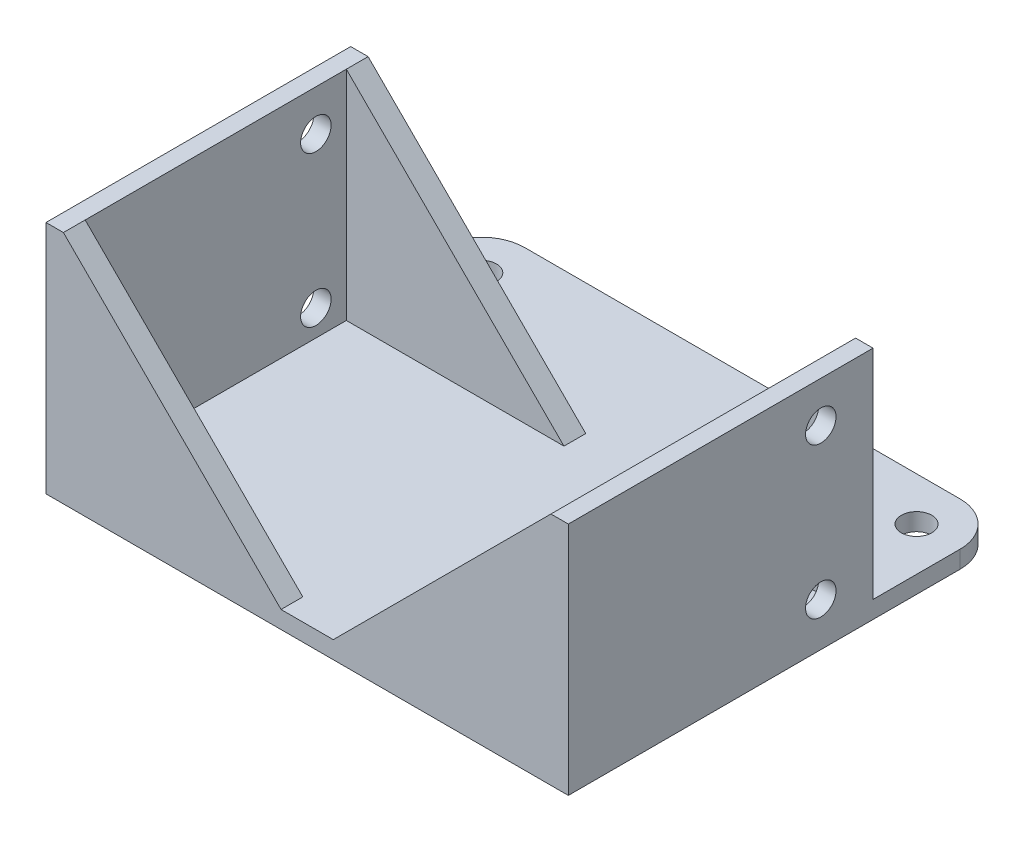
ISO-10303-21;
HEADER;
FILE_DESCRIPTION(('STEP AP214'),'2;1');
FILE_NAME('part.step','',(''),(''),'','','');
FILE_SCHEMA(('AUTOMOTIVE_DESIGN { 1 0 10303 214 1 1 1 1 }'));
ENDSEC;
DATA;
#1=APPLICATION_CONTEXT('core data for automotive mechanical design processes');
#2=APPLICATION_PROTOCOL_DEFINITION('international standard','automotive_design',2000,#1);
#3=PRODUCT_CONTEXT('',#1,'mechanical');
#4=PRODUCT('Part','Part','',(#3));
#5=PRODUCT_RELATED_PRODUCT_CATEGORY('part','',(#4));
#6=PRODUCT_DEFINITION_FORMATION('','',#4);
#7=PRODUCT_DEFINITION_CONTEXT('part definition',#1,'design');
#8=PRODUCT_DEFINITION('design','',#6,#7);
#9=PRODUCT_DEFINITION_SHAPE('','',#8);
#10=(LENGTH_UNIT() NAMED_UNIT(*) SI_UNIT(.MILLI.,.METRE.));
#11=(NAMED_UNIT(*) PLANE_ANGLE_UNIT() SI_UNIT($,.RADIAN.));
#12=(NAMED_UNIT(*) SI_UNIT($,.STERADIAN.) SOLID_ANGLE_UNIT());
#13=UNCERTAINTY_MEASURE_WITH_UNIT(LENGTH_MEASURE(1.E-05),#10,'distance_accuracy_value','');
#14=(GEOMETRIC_REPRESENTATION_CONTEXT(3) GLOBAL_UNCERTAINTY_ASSIGNED_CONTEXT((#13)) GLOBAL_UNIT_ASSIGNED_CONTEXT((#10,
#11,#12)) REPRESENTATION_CONTEXT('',''));
#15=CARTESIAN_POINT('',(0.,0.,0.));
#16=DIRECTION('',(0.,0.,1.));
#17=DIRECTION('',(1.,0.,0.));
#18=AXIS2_PLACEMENT_3D('',#15,#16,#17);
#19=CARTESIAN_POINT('',(-28.,27.,-48.1837661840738));
#20=DIRECTION('',(0.707106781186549,0.707106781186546,0.));
#21=DIRECTION('',(-0.707106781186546,0.707106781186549,0.));
#22=AXIS2_PLACEMENT_3D('',#19,#20,#21);
#23=PLANE('',#22);
#24=DIRECTION('',(0.,0.,1.));
#25=VECTOR('',#24,1.);
#26=CARTESIAN_POINT('',(-3.00000000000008,2.,-48.1837661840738));
#27=LINE('',#26,#25);
#28=CARTESIAN_POINT('',(-3.00000000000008,2.,22.5));
#29=VERTEX_POINT('',#28);
#30=CARTESIAN_POINT('',(-3.00000000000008,2.,25.));
#31=VERTEX_POINT('',#30);
#32=EDGE_CURVE('E249',#29,#31,#27,.T.);
#33=ORIENTED_EDGE('',*,*,#32,.F.);
#34=DIRECTION('',(-0.707106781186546,0.707106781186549,0.));
#35=VECTOR('',#34,1.);
#36=CARTESIAN_POINT('',(-28.,27.,22.5));
#37=LINE('',#36,#35);
#38=CARTESIAN_POINT('',(-28.,27.,22.5));
#39=VERTEX_POINT('',#38);
#40=EDGE_CURVE('E216',#29,#39,#37,.T.);
#41=ORIENTED_EDGE('',*,*,#40,.T.);
#42=DIRECTION('',(0.,0.,-1.));
#43=VECTOR('',#42,1.);
#44=CARTESIAN_POINT('',(-28.,27.,25.));
#45=LINE('',#44,#43);
#46=CARTESIAN_POINT('',(-28.,27.,25.));
#47=VERTEX_POINT('',#46);
#48=EDGE_CURVE('E286',#47,#39,#45,.T.);
#49=ORIENTED_EDGE('',*,*,#48,.F.);
#50=DIRECTION('',(-0.707106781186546,0.707106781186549,0.));
#51=VECTOR('',#50,1.);
#52=CARTESIAN_POINT('',(-28.,27.,25.));
#53=LINE('',#52,#51);
#54=EDGE_CURVE('E239',#31,#47,#53,.T.);
#55=ORIENTED_EDGE('',*,*,#54,.F.);
#56=EDGE_LOOP('',(#33,#41,#49,#55));
#57=FACE_BOUND('',#56,.T.);
#58=ADVANCED_FACE('F42',(#57),#23,.T.);
#59=CARTESIAN_POINT('',(28.,27.,-48.1837661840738));
#60=DIRECTION('',(-0.707106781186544,0.707106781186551,0.));
#61=DIRECTION('',(-0.707106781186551,-0.707106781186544,0.));
#62=AXIS2_PLACEMENT_3D('',#59,#60,#61);
#63=PLANE('',#62);
#64=DIRECTION('',(0.,0.,1.));
#65=VECTOR('',#64,1.);
#66=CARTESIAN_POINT('',(28.,27.,25.));
#67=LINE('',#66,#65);
#68=CARTESIAN_POINT('',(28.,27.,22.5));
#69=VERTEX_POINT('',#68);
#70=CARTESIAN_POINT('',(28.,27.,25.));
#71=VERTEX_POINT('',#70);
#72=EDGE_CURVE('E265',#69,#71,#67,.T.);
#73=ORIENTED_EDGE('',*,*,#72,.F.);
#74=DIRECTION('',(-0.707106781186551,-0.707106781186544,0.));
#75=VECTOR('',#74,1.);
#76=CARTESIAN_POINT('',(28.,27.,22.5));
#77=LINE('',#76,#75);
#78=CARTESIAN_POINT('',(2.99999999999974,2.,22.5));
#79=VERTEX_POINT('',#78);
#80=EDGE_CURVE('E334',#69,#79,#77,.T.);
#81=ORIENTED_EDGE('',*,*,#80,.T.);
#82=DIRECTION('',(0.,0.,1.));
#83=VECTOR('',#82,1.);
#84=CARTESIAN_POINT('',(2.99999999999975,2.,-48.1837661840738));
#85=LINE('',#84,#83);
#86=CARTESIAN_POINT('',(2.99999999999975,2.,25.));
#87=VERTEX_POINT('',#86);
#88=EDGE_CURVE('E231',#79,#87,#85,.T.);
#89=ORIENTED_EDGE('',*,*,#88,.T.);
#90=DIRECTION('',(-0.707106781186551,-0.707106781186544,0.));
#91=VECTOR('',#90,1.);
#92=CARTESIAN_POINT('',(28.,27.,25.));
#93=LINE('',#92,#91);
#94=EDGE_CURVE('E235',#71,#87,#93,.T.);
#95=ORIENTED_EDGE('',*,*,#94,.F.);
#96=EDGE_LOOP('',(#73,#81,#89,#95));
#97=FACE_BOUND('',#96,.T.);
#98=ADVANCED_FACE('F445',(#97),#63,.T.);
#99=CARTESIAN_POINT('',(0.,2.,0.));
#100=DIRECTION('',(0.,-1.,0.));
#101=DIRECTION('',(0.,0.,-1.));
#102=AXIS2_PLACEMENT_3D('',#99,#100,#101);
#103=PLANE('',#102);
#104=CARTESIAN_POINT('',(-25.,2.,-20.));
#105=DIRECTION('',(0.,-1.,0.));
#106=DIRECTION('',(0.,0.,-1.));
#107=AXIS2_PLACEMENT_3D('',#104,#105,#106);
#108=CIRCLE('',#107,1.75);
#109=CARTESIAN_POINT('',(-25.,2.,-21.75));
#110=VERTEX_POINT('',#109);
#111=EDGE_CURVE('E398',#110,#110,#108,.T.);
#112=ORIENTED_EDGE('',*,*,#111,.T.);
#113=EDGE_LOOP('',(#112));
#114=FACE_BOUND('',#113,.T.);
#115=CARTESIAN_POINT('',(25.,2.,-20.));
#116=DIRECTION('',(0.,-1.,0.));
#117=DIRECTION('',(0.,0.,-1.));
#118=AXIS2_PLACEMENT_3D('',#115,#116,#117);
#119=CIRCLE('',#118,1.75);
#120=CARTESIAN_POINT('',(25.,2.,-21.75));
#121=VERTEX_POINT('',#120);
#122=EDGE_CURVE('E385',#121,#121,#119,.T.);
#123=ORIENTED_EDGE('',*,*,#122,.T.);
#124=EDGE_LOOP('',(#123));
#125=FACE_BOUND('',#124,.T.);
#126=CARTESIAN_POINT('',(25.,2.,20.));
#127=DIRECTION('',(0.,-1.,0.));
#128=DIRECTION('',(0.,0.,-1.));
#129=AXIS2_PLACEMENT_3D('',#126,#127,#128);
#130=CIRCLE('',#129,1.75);
#131=CARTESIAN_POINT('',(25.,2.,18.25));
#132=VERTEX_POINT('',#131);
#133=EDGE_CURVE('E381',#132,#132,#130,.T.);
#134=ORIENTED_EDGE('',*,*,#133,.T.);
#135=EDGE_LOOP('',(#134));
#136=FACE_BOUND('',#135,.T.);
#137=CARTESIAN_POINT('',(-25.,2.,20.));
#138=DIRECTION('',(0.,-1.,0.));
#139=DIRECTION('',(0.,0.,-1.));
#140=AXIS2_PLACEMENT_3D('',#137,#138,#139);
#141=CIRCLE('',#140,1.75);
#142=CARTESIAN_POINT('',(-25.,2.,18.25));
#143=VERTEX_POINT('',#142);
#144=EDGE_CURVE('E377',#143,#143,#141,.T.);
#145=ORIENTED_EDGE('',*,*,#144,.T.);
#146=EDGE_LOOP('',(#145));
#147=FACE_BOUND('',#146,.T.);
#148=DIRECTION('',(-1.,0.,0.));
#149=VECTOR('',#148,1.);
#150=CARTESIAN_POINT('',(-30.,2.,-25.));
#151=LINE('',#150,#149);
#152=CARTESIAN_POINT('',(25.,2.,-25.));
#153=VERTEX_POINT('',#152);
#154=CARTESIAN_POINT('',(-25.,2.,-25.));
#155=VERTEX_POINT('',#154);
#156=EDGE_CURVE('E305',#153,#155,#151,.T.);
#157=ORIENTED_EDGE('',*,*,#156,.T.);
#158=CARTESIAN_POINT('',(-25.,2.,-20.));
#159=DIRECTION('',(0.,-1.,0.));
#160=DIRECTION('',(0.,0.,-1.));
#161=AXIS2_PLACEMENT_3D('',#158,#159,#160);
#162=CIRCLE('',#161,5.);
#163=CARTESIAN_POINT('',(-30.,2.,-20.));
#164=VERTEX_POINT('',#163);
#165=EDGE_CURVE('E52',#155,#164,#162,.F.);
#166=ORIENTED_EDGE('',*,*,#165,.T.);
#167=DIRECTION('',(0.,0.,1.));
#168=VECTOR('',#167,1.);
#169=CARTESIAN_POINT('',(-30.,2.,25.));
#170=LINE('',#169,#168);
#171=CARTESIAN_POINT('',(-30.,2.,-10.));
#172=VERTEX_POINT('',#171);
#173=EDGE_CURVE('E309',#164,#172,#170,.T.);
#174=ORIENTED_EDGE('',*,*,#173,.T.);
#175=DIRECTION('',(-1.,0.,0.));
#176=VECTOR('',#175,1.);
#177=CARTESIAN_POINT('',(-30.,2.,-10.));
#178=LINE('',#177,#176);
#179=CARTESIAN_POINT('',(-3.00000000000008,2.,-10.));
#180=VERTEX_POINT('',#179);
#181=EDGE_CURVE('E260',#180,#172,#178,.T.);
#182=ORIENTED_EDGE('',*,*,#181,.F.);
#183=CARTESIAN_POINT('',(-3.00000000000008,2.,-7.5));
#184=VERTEX_POINT('',#183);
#185=EDGE_CURVE('E245',#180,#184,#27,.T.);
#186=ORIENTED_EDGE('',*,*,#185,.T.);
#187=DIRECTION('',(1.,0.,0.));
#188=VECTOR('',#187,1.);
#189=CARTESIAN_POINT('',(-28.,2.,-7.5));
#190=LINE('',#189,#188);
#191=CARTESIAN_POINT('',(-28.,2.,-7.5));
#192=VERTEX_POINT('',#191);
#193=EDGE_CURVE('E194',#192,#184,#190,.T.);
#194=ORIENTED_EDGE('',*,*,#193,.F.);
#195=DIRECTION('',(0.,0.,-1.));
#196=VECTOR('',#195,1.);
#197=CARTESIAN_POINT('',(-28.,2.,22.5));
#198=LINE('',#197,#196);
#199=CARTESIAN_POINT('',(-28.,2.,22.5));
#200=VERTEX_POINT('',#199);
#201=EDGE_CURVE('E185',#200,#192,#198,.T.);
#202=ORIENTED_EDGE('',*,*,#201,.F.);
#203=DIRECTION('',(1.,0.,0.));
#204=VECTOR('',#203,1.);
#205=CARTESIAN_POINT('',(-28.,2.,22.5));
#206=LINE('',#205,#204);
#207=EDGE_CURVE('E205',#200,#29,#206,.T.);
#208=ORIENTED_EDGE('',*,*,#207,.T.);
#209=ORIENTED_EDGE('',*,*,#32,.T.);
#210=DIRECTION('',(1.,0.,0.));
#211=VECTOR('',#210,1.);
#212=CARTESIAN_POINT('',(-30.,2.,25.));
#213=LINE('',#212,#211);
#214=EDGE_CURVE('E312',#31,#87,#213,.T.);
#215=ORIENTED_EDGE('',*,*,#214,.T.);
#216=ORIENTED_EDGE('',*,*,#88,.F.);
#217=CARTESIAN_POINT('',(28.,2.,22.5));
#218=VERTEX_POINT('',#217);
#219=EDGE_CURVE('E200',#79,#218,#206,.T.);
#220=ORIENTED_EDGE('',*,*,#219,.T.);
#221=DIRECTION('',(0.,0.,-1.));
#222=VECTOR('',#221,1.);
#223=CARTESIAN_POINT('',(28.,2.,22.5));
#224=LINE('',#223,#222);
#225=CARTESIAN_POINT('',(28.,2.,-7.5));
#226=VERTEX_POINT('',#225);
#227=EDGE_CURVE('E177',#218,#226,#224,.T.);
#228=ORIENTED_EDGE('',*,*,#227,.T.);
#229=CARTESIAN_POINT('',(2.99999999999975,2.,-7.5));
#230=VERTEX_POINT('',#229);
#231=EDGE_CURVE('E187',#230,#226,#190,.T.);
#232=ORIENTED_EDGE('',*,*,#231,.F.);
#233=CARTESIAN_POINT('',(2.99999999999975,2.,-10.));
#234=VERTEX_POINT('',#233);
#235=EDGE_CURVE('E232',#234,#230,#85,.T.);
#236=ORIENTED_EDGE('',*,*,#235,.F.);
#237=DIRECTION('',(-1.,0.,0.));
#238=VECTOR('',#237,1.);
#239=CARTESIAN_POINT('',(30.,2.,-10.));
#240=LINE('',#239,#238);
#241=CARTESIAN_POINT('',(30.,2.,-10.));
#242=VERTEX_POINT('',#241);
#243=EDGE_CURVE('E257',#242,#234,#240,.T.);
#244=ORIENTED_EDGE('',*,*,#243,.F.);
#245=DIRECTION('',(0.,0.,-1.));
#246=VECTOR('',#245,1.);
#247=CARTESIAN_POINT('',(30.,2.,25.));
#248=LINE('',#247,#246);
#249=CARTESIAN_POINT('',(30.,2.,-20.));
#250=VERTEX_POINT('',#249);
#251=EDGE_CURVE('E302',#242,#250,#248,.T.);
#252=ORIENTED_EDGE('',*,*,#251,.T.);
#253=CARTESIAN_POINT('',(25.,2.,-20.));
#254=DIRECTION('',(0.,-1.,0.));
#255=DIRECTION('',(0.,0.,-1.));
#256=AXIS2_PLACEMENT_3D('',#253,#254,#255);
#257=CIRCLE('',#256,5.);
#258=EDGE_CURVE('E368',#250,#153,#257,.F.);
#259=ORIENTED_EDGE('',*,*,#258,.T.);
#260=EDGE_LOOP('',(#157,#166,#174,#182,#186,#194,#202,#208,#209,#215,#216,#220,#228,#232,#236,
#244,#252,#259));
#261=FACE_BOUND('',#260,.T.);
#262=ADVANCED_FACE('F198',(#114,#125,#136,#147,#261),#103,.F.);
#263=CARTESIAN_POINT('',(30.,2.,25.));
#264=DIRECTION('',(-1.,0.,0.));
#265=DIRECTION('',(0.,0.,1.));
#266=AXIS2_PLACEMENT_3D('',#263,#264,#265);
#267=PLANE('',#266);
#268=CARTESIAN_POINT('',(30.,22.3,-4.));
#269=DIRECTION('',(-1.,0.,0.));
#270=DIRECTION('',(0.,0.,1.));
#271=AXIS2_PLACEMENT_3D('',#268,#269,#270);
#272=CIRCLE('',#271,1.75);
#273=CARTESIAN_POINT('',(30.,22.3,-2.25));
#274=VERTEX_POINT('',#273);
#275=EDGE_CURVE('E346',#274,#274,#272,.T.);
#276=ORIENTED_EDGE('',*,*,#275,.T.);
#277=EDGE_LOOP('',(#276));
#278=FACE_BOUND('',#277,.T.);
#279=CARTESIAN_POINT('',(30.,5.,-4.));
#280=DIRECTION('',(-1.,0.,0.));
#281=DIRECTION('',(0.,0.,1.));
#282=AXIS2_PLACEMENT_3D('',#279,#280,#281);
#283=CIRCLE('',#282,1.75);
#284=CARTESIAN_POINT('',(30.,5.,-2.25));
#285=VERTEX_POINT('',#284);
#286=EDGE_CURVE('E402',#285,#285,#283,.T.);
#287=ORIENTED_EDGE('',*,*,#286,.T.);
#288=EDGE_LOOP('',(#287));
#289=FACE_BOUND('',#288,.T.);
#290=DIRECTION('',(0.,0.,-1.));
#291=VECTOR('',#290,1.);
#292=CARTESIAN_POINT('',(30.,0.,25.));
#293=LINE('',#292,#291);
#294=CARTESIAN_POINT('',(30.,0.,25.));
#295=VERTEX_POINT('',#294);
#296=CARTESIAN_POINT('',(30.,0.,-20.));
#297=VERTEX_POINT('',#296);
#298=EDGE_CURVE('E301',#295,#297,#293,.T.);
#299=ORIENTED_EDGE('',*,*,#298,.T.);
#300=DIRECTION('',(0.,-1.,0.));
#301=VECTOR('',#300,1.);
#302=CARTESIAN_POINT('',(30.,2.,-20.));
#303=LINE('',#302,#301);
#304=EDGE_CURVE('E11',#297,#250,#303,.F.);
#305=ORIENTED_EDGE('',*,*,#304,.T.);
#306=ORIENTED_EDGE('',*,*,#251,.F.);
#307=DIRECTION('',(0.,-1.,0.));
#308=VECTOR('',#307,1.);
#309=CARTESIAN_POINT('',(30.,27.,-10.));
#310=LINE('',#309,#308);
#311=CARTESIAN_POINT('',(30.,27.,-10.));
#312=VERTEX_POINT('',#311);
#313=EDGE_CURVE('E244',#312,#242,#310,.T.);
#314=ORIENTED_EDGE('',*,*,#313,.F.);
#315=DIRECTION('',(0.,0.,-1.));
#316=VECTOR('',#315,1.);
#317=CARTESIAN_POINT('',(30.,27.,25.));
#318=LINE('',#317,#316);
#319=CARTESIAN_POINT('',(30.,27.,25.));
#320=VERTEX_POINT('',#319);
#321=EDGE_CURVE('E261',#320,#312,#318,.T.);
#322=ORIENTED_EDGE('',*,*,#321,.F.);
#323=DIRECTION('',(0.,-1.,0.));
#324=VECTOR('',#323,1.);
#325=CARTESIAN_POINT('',(30.,2.,25.));
#326=LINE('',#325,#324);
#327=EDGE_CURVE('E316',#320,#295,#326,.T.);
#328=ORIENTED_EDGE('',*,*,#327,.T.);
#329=EDGE_LOOP('',(#299,#305,#306,#314,#322,#328));
#330=FACE_BOUND('',#329,.T.);
#331=ADVANCED_FACE('F508',(#278,#289,#330),#267,.F.);
#332=CARTESIAN_POINT('',(-30.,2.,-25.));
#333=DIRECTION('',(0.,0.,1.));
#334=DIRECTION('',(1.,0.,0.));
#335=AXIS2_PLACEMENT_3D('',#332,#333,#334);
#336=PLANE('',#335);
#337=DIRECTION('',(-1.,0.,0.));
#338=VECTOR('',#337,1.);
#339=CARTESIAN_POINT('',(-30.,0.,-25.));
#340=LINE('',#339,#338);
#341=CARTESIAN_POINT('',(25.,0.,-25.));
#342=VERTEX_POINT('',#341);
#343=CARTESIAN_POINT('',(-25.,0.,-25.));
#344=VERTEX_POINT('',#343);
#345=EDGE_CURVE('E319',#342,#344,#340,.T.);
#346=ORIENTED_EDGE('',*,*,#345,.T.);
#347=DIRECTION('',(0.,-1.,0.));
#348=VECTOR('',#347,1.);
#349=CARTESIAN_POINT('',(-25.,2.,-25.));
#350=LINE('',#349,#348);
#351=EDGE_CURVE('E66',#344,#155,#350,.F.);
#352=ORIENTED_EDGE('',*,*,#351,.T.);
#353=ORIENTED_EDGE('',*,*,#156,.F.);
#354=DIRECTION('',(0.,-1.,0.));
#355=VECTOR('',#354,1.);
#356=CARTESIAN_POINT('',(25.,2.,-25.));
#357=LINE('',#356,#355);
#358=EDGE_CURVE('E362',#153,#342,#357,.T.);
#359=ORIENTED_EDGE('',*,*,#358,.T.);
#360=EDGE_LOOP('',(#346,#352,#353,#359));
#361=FACE_BOUND('',#360,.T.);
#362=ADVANCED_FACE('F514',(#361),#336,.F.);
#363=CARTESIAN_POINT('',(-30.,2.,25.));
#364=DIRECTION('',(1.,0.,0.));
#365=DIRECTION('',(0.,0.,-1.));
#366=AXIS2_PLACEMENT_3D('',#363,#364,#365);
#367=PLANE('',#366);
#368=CARTESIAN_POINT('',(-30.,22.3,-4.));
#369=DIRECTION('',(1.,0.,0.));
#370=DIRECTION('',(0.,0.,-1.));
#371=AXIS2_PLACEMENT_3D('',#368,#369,#370);
#372=CIRCLE('',#371,1.75);
#373=CARTESIAN_POINT('',(-30.,22.3,-5.75));
#374=VERTEX_POINT('',#373);
#375=EDGE_CURVE('E195',#374,#374,#372,.T.);
#376=ORIENTED_EDGE('',*,*,#375,.T.);
#377=EDGE_LOOP('',(#376));
#378=FACE_BOUND('',#377,.T.);
#379=CARTESIAN_POINT('',(-30.,5.,-4.));
#380=DIRECTION('',(1.,0.,0.));
#381=DIRECTION('',(0.,0.,-1.));
#382=AXIS2_PLACEMENT_3D('',#379,#380,#381);
#383=CIRCLE('',#382,1.75);
#384=CARTESIAN_POINT('',(-30.,5.,-5.75));
#385=VERTEX_POINT('',#384);
#386=EDGE_CURVE('E352',#385,#385,#383,.T.);
#387=ORIENTED_EDGE('',*,*,#386,.T.);
#388=EDGE_LOOP('',(#387));
#389=FACE_BOUND('',#388,.T.);
#390=ORIENTED_EDGE('',*,*,#173,.F.);
#391=DIRECTION('',(0.,-1.,0.));
#392=VECTOR('',#391,1.);
#393=CARTESIAN_POINT('',(-30.,2.,-20.));
#394=LINE('',#393,#392);
#395=CARTESIAN_POINT('',(-30.,0.,-20.));
#396=VERTEX_POINT('',#395);
#397=EDGE_CURVE('E340',#164,#396,#394,.T.);
#398=ORIENTED_EDGE('',*,*,#397,.T.);
#399=DIRECTION('',(0.,0.,1.));
#400=VECTOR('',#399,1.);
#401=CARTESIAN_POINT('',(-30.,0.,25.));
#402=LINE('',#401,#400);
#403=CARTESIAN_POINT('',(-30.,0.,25.));
#404=VERTEX_POINT('',#403);
#405=EDGE_CURVE('E322',#396,#404,#402,.T.);
#406=ORIENTED_EDGE('',*,*,#405,.T.);
#407=DIRECTION('',(0.,-1.,0.));
#408=VECTOR('',#407,1.);
#409=CARTESIAN_POINT('',(-30.,2.,25.));
#410=LINE('',#409,#408);
#411=CARTESIAN_POINT('',(-30.,27.,25.));
#412=VERTEX_POINT('',#411);
#413=EDGE_CURVE('E330',#412,#404,#410,.T.);
#414=ORIENTED_EDGE('',*,*,#413,.F.);
#415=DIRECTION('',(0.,0.,1.));
#416=VECTOR('',#415,1.);
#417=CARTESIAN_POINT('',(-30.,27.,25.));
#418=LINE('',#417,#416);
#419=CARTESIAN_POINT('',(-30.,27.,-10.));
#420=VERTEX_POINT('',#419);
#421=EDGE_CURVE('E277',#420,#412,#418,.T.);
#422=ORIENTED_EDGE('',*,*,#421,.F.);
#423=DIRECTION('',(0.,-1.,0.));
#424=VECTOR('',#423,1.);
#425=CARTESIAN_POINT('',(-30.,27.,-10.));
#426=LINE('',#425,#424);
#427=EDGE_CURVE('E294',#420,#172,#426,.T.);
#428=ORIENTED_EDGE('',*,*,#427,.T.);
#429=EDGE_LOOP('',(#390,#398,#406,#414,#422,#428));
#430=FACE_BOUND('',#429,.T.);
#431=ADVANCED_FACE('F421',(#378,#389,#430),#367,.F.);
#432=CARTESIAN_POINT('',(-30.,2.,25.));
#433=DIRECTION('',(0.,0.,-1.));
#434=DIRECTION('',(-1.,0.,0.));
#435=AXIS2_PLACEMENT_3D('',#432,#433,#434);
#436=PLANE('',#435);
#437=DIRECTION('',(1.,0.,0.));
#438=VECTOR('',#437,1.);
#439=CARTESIAN_POINT('',(-30.,0.,25.));
#440=LINE('',#439,#438);
#441=EDGE_CURVE('E306',#404,#295,#440,.T.);
#442=ORIENTED_EDGE('',*,*,#441,.T.);
#443=ORIENTED_EDGE('',*,*,#327,.F.);
#444=DIRECTION('',(1.,0.,0.));
#445=VECTOR('',#444,1.);
#446=CARTESIAN_POINT('',(30.,27.,25.));
#447=LINE('',#446,#445);
#448=EDGE_CURVE('E256',#71,#320,#447,.T.);
#449=ORIENTED_EDGE('',*,*,#448,.F.);
#450=ORIENTED_EDGE('',*,*,#94,.T.);
#451=ORIENTED_EDGE('',*,*,#214,.F.);
#452=ORIENTED_EDGE('',*,*,#54,.T.);
#453=DIRECTION('',(1.,0.,0.));
#454=VECTOR('',#453,1.);
#455=CARTESIAN_POINT('',(-30.,27.,25.));
#456=LINE('',#455,#454);
#457=EDGE_CURVE('E281',#412,#47,#456,.T.);
#458=ORIENTED_EDGE('',*,*,#457,.F.);
#459=ORIENTED_EDGE('',*,*,#413,.T.);
#460=EDGE_LOOP('',(#442,#443,#449,#450,#451,#452,#458,#459));
#461=FACE_BOUND('',#460,.T.);
#462=ADVANCED_FACE('F496',(#461),#436,.F.);
#463=CARTESIAN_POINT('',(0.,0.,0.));
#464=DIRECTION('',(0.,-1.,0.));
#465=DIRECTION('',(0.,0.,-1.));
#466=AXIS2_PLACEMENT_3D('',#463,#464,#465);
#467=PLANE('',#466);
#468=CARTESIAN_POINT('',(-25.,0.,-20.));
#469=DIRECTION('',(0.,-1.,0.));
#470=DIRECTION('',(0.,0.,-1.));
#471=AXIS2_PLACEMENT_3D('',#468,#469,#470);
#472=CIRCLE('',#471,1.75);
#473=CARTESIAN_POINT('',(-25.,0.,-21.75));
#474=VERTEX_POINT('',#473);
#475=EDGE_CURVE('E46',#474,#474,#472,.T.);
#476=ORIENTED_EDGE('',*,*,#475,.F.);
#477=EDGE_LOOP('',(#476));
#478=FACE_BOUND('',#477,.T.);
#479=CARTESIAN_POINT('',(25.,0.,-20.));
#480=DIRECTION('',(0.,-1.,0.));
#481=DIRECTION('',(0.,0.,-1.));
#482=AXIS2_PLACEMENT_3D('',#479,#480,#481);
#483=CIRCLE('',#482,1.75);
#484=CARTESIAN_POINT('',(25.,0.,-21.75));
#485=VERTEX_POINT('',#484);
#486=EDGE_CURVE('E382',#485,#485,#483,.T.);
#487=ORIENTED_EDGE('',*,*,#486,.F.);
#488=EDGE_LOOP('',(#487));
#489=FACE_BOUND('',#488,.T.);
#490=CARTESIAN_POINT('',(25.,0.,20.));
#491=DIRECTION('',(0.,-1.,0.));
#492=DIRECTION('',(0.,0.,-1.));
#493=AXIS2_PLACEMENT_3D('',#490,#491,#492);
#494=CIRCLE('',#493,1.75);
#495=CARTESIAN_POINT('',(25.,0.,18.25));
#496=VERTEX_POINT('',#495);
#497=EDGE_CURVE('E378',#496,#496,#494,.T.);
#498=ORIENTED_EDGE('',*,*,#497,.F.);
#499=EDGE_LOOP('',(#498));
#500=FACE_BOUND('',#499,.T.);
#501=CARTESIAN_POINT('',(-25.,0.,20.));
#502=DIRECTION('',(0.,-1.,0.));
#503=DIRECTION('',(0.,0.,-1.));
#504=AXIS2_PLACEMENT_3D('',#501,#502,#503);
#505=CIRCLE('',#504,1.75);
#506=CARTESIAN_POINT('',(-25.,0.,18.25));
#507=VERTEX_POINT('',#506);
#508=EDGE_CURVE('E373',#507,#507,#505,.T.);
#509=ORIENTED_EDGE('',*,*,#508,.F.);
#510=EDGE_LOOP('',(#509));
#511=FACE_BOUND('',#510,.T.);
#512=ORIENTED_EDGE('',*,*,#405,.F.);
#513=CARTESIAN_POINT('',(-25.,0.,-20.));
#514=DIRECTION('',(0.,-1.,0.));
#515=DIRECTION('',(0.,0.,-1.));
#516=AXIS2_PLACEMENT_3D('',#513,#514,#515);
#517=CIRCLE('',#516,5.);
#518=EDGE_CURVE('E359',#396,#344,#517,.T.);
#519=ORIENTED_EDGE('',*,*,#518,.T.);
#520=ORIENTED_EDGE('',*,*,#345,.F.);
#521=CARTESIAN_POINT('',(25.,0.,-20.));
#522=DIRECTION('',(0.,-1.,0.));
#523=DIRECTION('',(0.,0.,-1.));
#524=AXIS2_PLACEMENT_3D('',#521,#522,#523);
#525=CIRCLE('',#524,5.);
#526=EDGE_CURVE('E356',#342,#297,#525,.T.);
#527=ORIENTED_EDGE('',*,*,#526,.T.);
#528=ORIENTED_EDGE('',*,*,#298,.F.);
#529=ORIENTED_EDGE('',*,*,#441,.F.);
#530=EDGE_LOOP('',(#512,#519,#520,#527,#528,#529));
#531=FACE_BOUND('',#530,.T.);
#532=ADVANCED_FACE('F506',(#478,#489,#500,#511,#531),#467,.T.);
#533=CARTESIAN_POINT('',(-30.,27.,-10.));
#534=DIRECTION('',(0.,0.,1.));
#535=DIRECTION('',(1.,0.,0.));
#536=AXIS2_PLACEMENT_3D('',#533,#534,#535);
#537=PLANE('',#536);
#538=ORIENTED_EDGE('',*,*,#181,.T.);
#539=ORIENTED_EDGE('',*,*,#427,.F.);
#540=DIRECTION('',(-1.,0.,0.));
#541=VECTOR('',#540,1.);
#542=CARTESIAN_POINT('',(-30.,27.,-10.));
#543=LINE('',#542,#541);
#544=CARTESIAN_POINT('',(-28.,27.,-10.));
#545=VERTEX_POINT('',#544);
#546=EDGE_CURVE('E290',#545,#420,#543,.T.);
#547=ORIENTED_EDGE('',*,*,#546,.F.);
#548=DIRECTION('',(0.707106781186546,-0.707106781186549,0.));
#549=VECTOR('',#548,1.);
#550=CARTESIAN_POINT('',(-28.,27.,-10.));
#551=LINE('',#550,#549);
#552=EDGE_CURVE('E240',#545,#180,#551,.T.);
#553=ORIENTED_EDGE('',*,*,#552,.T.);
#554=EDGE_LOOP('',(#538,#539,#547,#553));
#555=FACE_BOUND('',#554,.T.);
#556=ADVANCED_FACE('F481',(#555),#537,.F.);
#557=CARTESIAN_POINT('',(0.,27.,0.));
#558=DIRECTION('',(0.,-1.,0.));
#559=DIRECTION('',(0.,0.,-1.));
#560=AXIS2_PLACEMENT_3D('',#557,#558,#559);
#561=PLANE('',#560);
#562=ORIENTED_EDGE('',*,*,#421,.T.);
#563=ORIENTED_EDGE('',*,*,#457,.T.);
#564=ORIENTED_EDGE('',*,*,#48,.T.);
#565=CARTESIAN_POINT('',(-28.,27.,-7.5));
#566=VERTEX_POINT('',#565);
#567=EDGE_CURVE('E291',#39,#566,#45,.T.);
#568=ORIENTED_EDGE('',*,*,#567,.T.);
#569=EDGE_CURVE('E285',#566,#545,#45,.T.);
#570=ORIENTED_EDGE('',*,*,#569,.T.);
#571=ORIENTED_EDGE('',*,*,#546,.T.);
#572=EDGE_LOOP('',(#562,#563,#564,#568,#570,#571));
#573=FACE_BOUND('',#572,.T.);
#574=ADVANCED_FACE('F484',(#573),#561,.F.);
#575=CARTESIAN_POINT('',(30.,27.,-10.));
#576=DIRECTION('',(0.,0.,1.));
#577=DIRECTION('',(1.,0.,0.));
#578=AXIS2_PLACEMENT_3D('',#575,#576,#577);
#579=PLANE('',#578);
#580=ORIENTED_EDGE('',*,*,#243,.T.);
#581=DIRECTION('',(0.707106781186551,0.707106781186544,0.));
#582=VECTOR('',#581,1.);
#583=CARTESIAN_POINT('',(28.,27.,-10.));
#584=LINE('',#583,#582);
#585=CARTESIAN_POINT('',(28.,27.,-10.));
#586=VERTEX_POINT('',#585);
#587=EDGE_CURVE('E228',#234,#586,#584,.T.);
#588=ORIENTED_EDGE('',*,*,#587,.T.);
#589=DIRECTION('',(-1.,0.,0.));
#590=VECTOR('',#589,1.);
#591=CARTESIAN_POINT('',(30.,27.,-10.));
#592=LINE('',#591,#590);
#593=EDGE_CURVE('E270',#312,#586,#592,.T.);
#594=ORIENTED_EDGE('',*,*,#593,.F.);
#595=ORIENTED_EDGE('',*,*,#313,.T.);
#596=EDGE_LOOP('',(#580,#588,#594,#595));
#597=FACE_BOUND('',#596,.T.);
#598=ADVANCED_FACE('F465',(#597),#579,.F.);
#599=CARTESIAN_POINT('',(0.,27.,0.));
#600=DIRECTION('',(0.,1.,0.));
#601=DIRECTION('',(0.,0.,1.));
#602=AXIS2_PLACEMENT_3D('',#599,#600,#601);
#603=PLANE('',#602);
#604=ORIENTED_EDGE('',*,*,#321,.T.);
#605=ORIENTED_EDGE('',*,*,#593,.T.);
#606=CARTESIAN_POINT('',(28.,27.,-7.5));
#607=VERTEX_POINT('',#606);
#608=EDGE_CURVE('E266',#586,#607,#67,.T.);
#609=ORIENTED_EDGE('',*,*,#608,.T.);
#610=EDGE_CURVE('E179',#607,#69,#67,.T.);
#611=ORIENTED_EDGE('',*,*,#610,.T.);
#612=ORIENTED_EDGE('',*,*,#72,.T.);
#613=ORIENTED_EDGE('',*,*,#448,.T.);
#614=EDGE_LOOP('',(#604,#605,#609,#611,#612,#613));
#615=FACE_BOUND('',#614,.T.);
#616=ADVANCED_FACE('F458',(#615),#603,.T.);
#617=DIRECTION('',(-0.707106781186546,0.707106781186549,0.));
#618=VECTOR('',#617,1.);
#619=CARTESIAN_POINT('',(-28.,27.,-7.5));
#620=LINE('',#619,#618);
#621=EDGE_CURVE('E225',#184,#566,#620,.T.);
#622=ORIENTED_EDGE('',*,*,#621,.F.);
#623=ORIENTED_EDGE('',*,*,#185,.F.);
#624=ORIENTED_EDGE('',*,*,#552,.F.);
#625=ORIENTED_EDGE('',*,*,#569,.F.);
#626=EDGE_LOOP('',(#622,#623,#624,#625));
#627=FACE_BOUND('',#626,.T.);
#628=ADVANCED_FACE('F448',(#627),#23,.T.);
#629=DIRECTION('',(-0.707106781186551,-0.707106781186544,0.));
#630=VECTOR('',#629,1.);
#631=CARTESIAN_POINT('',(28.,27.,-7.5));
#632=LINE('',#631,#630);
#633=EDGE_CURVE('E189',#607,#230,#632,.T.);
#634=ORIENTED_EDGE('',*,*,#633,.F.);
#635=ORIENTED_EDGE('',*,*,#608,.F.);
#636=ORIENTED_EDGE('',*,*,#587,.F.);
#637=ORIENTED_EDGE('',*,*,#235,.T.);
#638=EDGE_LOOP('',(#634,#635,#636,#637));
#639=FACE_BOUND('',#638,.T.);
#640=ADVANCED_FACE('F454',(#639),#63,.T.);
#641=CARTESIAN_POINT('',(28.,33.,22.5));
#642=DIRECTION('',(-1.,0.,0.));
#643=DIRECTION('',(0.,0.,1.));
#644=AXIS2_PLACEMENT_3D('',#641,#642,#643);
#645=PLANE('',#644);
#646=CARTESIAN_POINT('',(28.,22.3,-4.));
#647=DIRECTION('',(-1.,0.,0.));
#648=DIRECTION('',(0.,0.,1.));
#649=AXIS2_PLACEMENT_3D('',#646,#647,#648);
#650=CIRCLE('',#649,1.75);
#651=CARTESIAN_POINT('',(28.,22.3,-2.25));
#652=VERTEX_POINT('',#651);
#653=EDGE_CURVE('E351',#652,#652,#650,.T.);
#654=ORIENTED_EDGE('',*,*,#653,.F.);
#655=EDGE_LOOP('',(#654));
#656=FACE_BOUND('',#655,.T.);
#657=CARTESIAN_POINT('',(28.,5.,-4.));
#658=DIRECTION('',(-1.,0.,0.));
#659=DIRECTION('',(0.,0.,1.));
#660=AXIS2_PLACEMENT_3D('',#657,#658,#659);
#661=CIRCLE('',#660,1.75);
#662=CARTESIAN_POINT('',(28.,5.,-2.25));
#663=VERTEX_POINT('',#662);
#664=EDGE_CURVE('E345',#663,#663,#661,.T.);
#665=ORIENTED_EDGE('',*,*,#664,.F.);
#666=EDGE_LOOP('',(#665));
#667=FACE_BOUND('',#666,.T.);
#668=DIRECTION('',(0.,-1.,0.));
#669=VECTOR('',#668,1.);
#670=CARTESIAN_POINT('',(28.,33.,-7.5));
#671=LINE('',#670,#669);
#672=EDGE_CURVE('E172',#607,#226,#671,.T.);
#673=ORIENTED_EDGE('',*,*,#672,.T.);
#674=ORIENTED_EDGE('',*,*,#227,.F.);
#675=DIRECTION('',(0.,-1.,0.));
#676=VECTOR('',#675,1.);
#677=CARTESIAN_POINT('',(28.,33.,22.5));
#678=LINE('',#677,#676);
#679=EDGE_CURVE('E184',#69,#218,#678,.T.);
#680=ORIENTED_EDGE('',*,*,#679,.F.);
#681=ORIENTED_EDGE('',*,*,#610,.F.);
#682=EDGE_LOOP('',(#673,#674,#680,#681));
#683=FACE_BOUND('',#682,.T.);
#684=ADVANCED_FACE('F174',(#656,#667,#683),#645,.T.);
#685=CARTESIAN_POINT('',(-28.,33.,22.5));
#686=DIRECTION('',(0.,0.,-1.));
#687=DIRECTION('',(-1.,0.,0.));
#688=AXIS2_PLACEMENT_3D('',#685,#686,#687);
#689=PLANE('',#688);
#690=ORIENTED_EDGE('',*,*,#679,.T.);
#691=ORIENTED_EDGE('',*,*,#219,.F.);
#692=ORIENTED_EDGE('',*,*,#80,.F.);
#693=EDGE_LOOP('',(#690,#691,#692));
#694=FACE_BOUND('',#693,.T.);
#695=ADVANCED_FACE('F625',(#694),#689,.T.);
#696=CARTESIAN_POINT('',(-28.,33.,-7.5));
#697=DIRECTION('',(0.,0.,-1.));
#698=DIRECTION('',(-1.,0.,0.));
#699=AXIS2_PLACEMENT_3D('',#696,#697,#698);
#700=PLANE('',#699);
#701=ORIENTED_EDGE('',*,*,#633,.T.);
#702=ORIENTED_EDGE('',*,*,#231,.T.);
#703=ORIENTED_EDGE('',*,*,#672,.F.);
#704=EDGE_LOOP('',(#701,#702,#703));
#705=FACE_BOUND('',#704,.T.);
#706=ADVANCED_FACE('F188',(#705),#700,.F.);
#707=ORIENTED_EDGE('',*,*,#621,.T.);
#708=DIRECTION('',(0.,-1.,0.));
#709=VECTOR('',#708,1.);
#710=CARTESIAN_POINT('',(-28.,33.,-7.5));
#711=LINE('',#710,#709);
#712=EDGE_CURVE('E213',#566,#192,#711,.T.);
#713=ORIENTED_EDGE('',*,*,#712,.T.);
#714=ORIENTED_EDGE('',*,*,#193,.T.);
#715=EDGE_LOOP('',(#707,#713,#714));
#716=FACE_BOUND('',#715,.T.);
#717=ADVANCED_FACE('F642',(#716),#700,.F.);
#718=ORIENTED_EDGE('',*,*,#207,.F.);
#719=DIRECTION('',(0.,-1.,0.));
#720=VECTOR('',#719,1.);
#721=CARTESIAN_POINT('',(-28.,33.,22.5));
#722=LINE('',#721,#720);
#723=EDGE_CURVE('E217',#39,#200,#722,.T.);
#724=ORIENTED_EDGE('',*,*,#723,.F.);
#725=ORIENTED_EDGE('',*,*,#40,.F.);
#726=EDGE_LOOP('',(#718,#724,#725));
#727=FACE_BOUND('',#726,.T.);
#728=ADVANCED_FACE('F632',(#727),#689,.T.);
#729=CARTESIAN_POINT('',(-28.,33.,22.5));
#730=DIRECTION('',(-1.,0.,0.));
#731=DIRECTION('',(0.,0.,1.));
#732=AXIS2_PLACEMENT_3D('',#729,#730,#731);
#733=PLANE('',#732);
#734=CARTESIAN_POINT('',(-28.,22.3,-4.));
#735=DIRECTION('',(-1.,0.,0.));
#736=DIRECTION('',(0.,0.,1.));
#737=AXIS2_PLACEMENT_3D('',#734,#735,#736);
#738=CIRCLE('',#737,1.75);
#739=CARTESIAN_POINT('',(-28.,22.3,-2.25));
#740=VERTEX_POINT('',#739);
#741=EDGE_CURVE('E347',#740,#740,#738,.T.);
#742=ORIENTED_EDGE('',*,*,#741,.T.);
#743=EDGE_LOOP('',(#742));
#744=FACE_BOUND('',#743,.T.);
#745=CARTESIAN_POINT('',(-28.,5.,-4.));
#746=DIRECTION('',(-1.,0.,0.));
#747=DIRECTION('',(0.,0.,1.));
#748=AXIS2_PLACEMENT_3D('',#745,#746,#747);
#749=CIRCLE('',#748,1.75);
#750=CARTESIAN_POINT('',(-28.,5.,-2.25));
#751=VERTEX_POINT('',#750);
#752=EDGE_CURVE('E341',#751,#751,#749,.T.);
#753=ORIENTED_EDGE('',*,*,#752,.T.);
#754=EDGE_LOOP('',(#753));
#755=FACE_BOUND('',#754,.T.);
#756=ORIENTED_EDGE('',*,*,#567,.F.);
#757=ORIENTED_EDGE('',*,*,#723,.T.);
#758=ORIENTED_EDGE('',*,*,#201,.T.);
#759=ORIENTED_EDGE('',*,*,#712,.F.);
#760=EDGE_LOOP('',(#756,#757,#758,#759));
#761=FACE_BOUND('',#760,.T.);
#762=ADVANCED_FACE('F437',(#744,#755,#761),#733,.F.);
#763=CARTESIAN_POINT('',(30.,5.,-4.));
#764=DIRECTION('',(-1.,0.,0.));
#765=DIRECTION('',(0.,0.,1.));
#766=AXIS2_PLACEMENT_3D('',#763,#764,#765);
#767=CYLINDRICAL_SURFACE('',#766,1.75);
#768=ORIENTED_EDGE('',*,*,#752,.F.);
#769=EDGE_LOOP('',(#768));
#770=FACE_BOUND('',#769,.T.);
#771=ORIENTED_EDGE('',*,*,#386,.F.);
#772=EDGE_LOOP('',(#771));
#773=FACE_BOUND('',#772,.T.);
#774=ADVANCED_FACE('F427',(#770,#773),#767,.F.);
#775=CARTESIAN_POINT('',(30.,22.3,-4.));
#776=DIRECTION('',(-1.,0.,0.));
#777=DIRECTION('',(0.,0.,1.));
#778=AXIS2_PLACEMENT_3D('',#775,#776,#777);
#779=CYLINDRICAL_SURFACE('',#778,1.75);
#780=ORIENTED_EDGE('',*,*,#741,.F.);
#781=EDGE_LOOP('',(#780));
#782=FACE_BOUND('',#781,.T.);
#783=ORIENTED_EDGE('',*,*,#375,.F.);
#784=EDGE_LOOP('',(#783));
#785=FACE_BOUND('',#784,.T.);
#786=ADVANCED_FACE('F424',(#782,#785),#779,.F.);
#787=ORIENTED_EDGE('',*,*,#664,.T.);
#788=EDGE_LOOP('',(#787));
#789=FACE_BOUND('',#788,.T.);
#790=ORIENTED_EDGE('',*,*,#286,.F.);
#791=EDGE_LOOP('',(#790));
#792=FACE_BOUND('',#791,.T.);
#793=ADVANCED_FACE('F426',(#789,#792),#767,.F.);
#794=ORIENTED_EDGE('',*,*,#653,.T.);
#795=EDGE_LOOP('',(#794));
#796=FACE_BOUND('',#795,.T.);
#797=ORIENTED_EDGE('',*,*,#275,.F.);
#798=EDGE_LOOP('',(#797));
#799=FACE_BOUND('',#798,.T.);
#800=ADVANCED_FACE('F430',(#796,#799),#779,.F.);
#801=CARTESIAN_POINT('',(-25.,2.,-20.));
#802=DIRECTION('',(0.,-1.,0.));
#803=DIRECTION('',(0.,0.,-1.));
#804=AXIS2_PLACEMENT_3D('',#801,#802,#803);
#805=CYLINDRICAL_SURFACE('',#804,5.);
#806=ORIENTED_EDGE('',*,*,#165,.F.);
#807=ORIENTED_EDGE('',*,*,#351,.F.);
#808=ORIENTED_EDGE('',*,*,#518,.F.);
#809=ORIENTED_EDGE('',*,*,#397,.F.);
#810=EDGE_LOOP('',(#806,#807,#808,#809));
#811=FACE_BOUND('',#810,.T.);
#812=ADVANCED_FACE('F442',(#811),#805,.T.);
#813=CARTESIAN_POINT('',(25.,2.,-20.));
#814=DIRECTION('',(0.,-1.,0.));
#815=DIRECTION('',(0.,0.,-1.));
#816=AXIS2_PLACEMENT_3D('',#813,#814,#815);
#817=CYLINDRICAL_SURFACE('',#816,5.);
#818=ORIENTED_EDGE('',*,*,#258,.F.);
#819=ORIENTED_EDGE('',*,*,#304,.F.);
#820=ORIENTED_EDGE('',*,*,#526,.F.);
#821=ORIENTED_EDGE('',*,*,#358,.F.);
#822=EDGE_LOOP('',(#818,#819,#820,#821));
#823=FACE_BOUND('',#822,.T.);
#824=ADVANCED_FACE('F44',(#823),#817,.T.);
#825=CARTESIAN_POINT('',(-25.,27.,20.));
#826=DIRECTION('',(0.,-1.,0.));
#827=DIRECTION('',(0.,0.,-1.));
#828=AXIS2_PLACEMENT_3D('',#825,#826,#827);
#829=CYLINDRICAL_SURFACE('',#828,1.75);
#830=ORIENTED_EDGE('',*,*,#508,.T.);
#831=EDGE_LOOP('',(#830));
#832=FACE_BOUND('',#831,.T.);
#833=ORIENTED_EDGE('',*,*,#144,.F.);
#834=EDGE_LOOP('',(#833));
#835=FACE_BOUND('',#834,.T.);
#836=ADVANCED_FACE('F533',(#832,#835),#829,.F.);
#837=CARTESIAN_POINT('',(25.,27.,20.));
#838=DIRECTION('',(0.,-1.,0.));
#839=DIRECTION('',(0.,0.,-1.));
#840=AXIS2_PLACEMENT_3D('',#837,#838,#839);
#841=CYLINDRICAL_SURFACE('',#840,1.75);
#842=ORIENTED_EDGE('',*,*,#497,.T.);
#843=EDGE_LOOP('',(#842));
#844=FACE_BOUND('',#843,.T.);
#845=ORIENTED_EDGE('',*,*,#133,.F.);
#846=EDGE_LOOP('',(#845));
#847=FACE_BOUND('',#846,.T.);
#848=ADVANCED_FACE('F537',(#844,#847),#841,.F.);
#849=CARTESIAN_POINT('',(25.,27.,-20.));
#850=DIRECTION('',(0.,-1.,0.));
#851=DIRECTION('',(0.,0.,-1.));
#852=AXIS2_PLACEMENT_3D('',#849,#850,#851);
#853=CYLINDRICAL_SURFACE('',#852,1.75);
#854=ORIENTED_EDGE('',*,*,#486,.T.);
#855=EDGE_LOOP('',(#854));
#856=FACE_BOUND('',#855,.T.);
#857=ORIENTED_EDGE('',*,*,#122,.F.);
#858=EDGE_LOOP('',(#857));
#859=FACE_BOUND('',#858,.T.);
#860=ADVANCED_FACE('F542',(#856,#859),#853,.F.);
#861=CARTESIAN_POINT('',(-25.,27.,-20.));
#862=DIRECTION('',(0.,-1.,0.));
#863=DIRECTION('',(0.,0.,-1.));
#864=AXIS2_PLACEMENT_3D('',#861,#862,#863);
#865=CYLINDRICAL_SURFACE('',#864,1.75);
#866=ORIENTED_EDGE('',*,*,#475,.T.);
#867=EDGE_LOOP('',(#866));
#868=FACE_BOUND('',#867,.T.);
#869=ORIENTED_EDGE('',*,*,#111,.F.);
#870=EDGE_LOOP('',(#869));
#871=FACE_BOUND('',#870,.T.);
#872=ADVANCED_FACE('F547',(#868,#871),#865,.F.);
#873=CLOSED_SHELL('',(#58,#98,#262,#331,#362,#431,#462,#532,#556,#574,#598,#616,#628,#640,#684,
#695,#706,#717,#728,#762,#774,#786,#793,#800,#812,#824,#836,#848,#860,#872));
#874=MANIFOLD_SOLID_BREP('B2',#873);
#875=ADVANCED_BREP_SHAPE_REPRESENTATION('',(#18,#874),#14);
#876=SHAPE_DEFINITION_REPRESENTATION(#9,#875);
ENDSEC;
END-ISO-10303-21;
